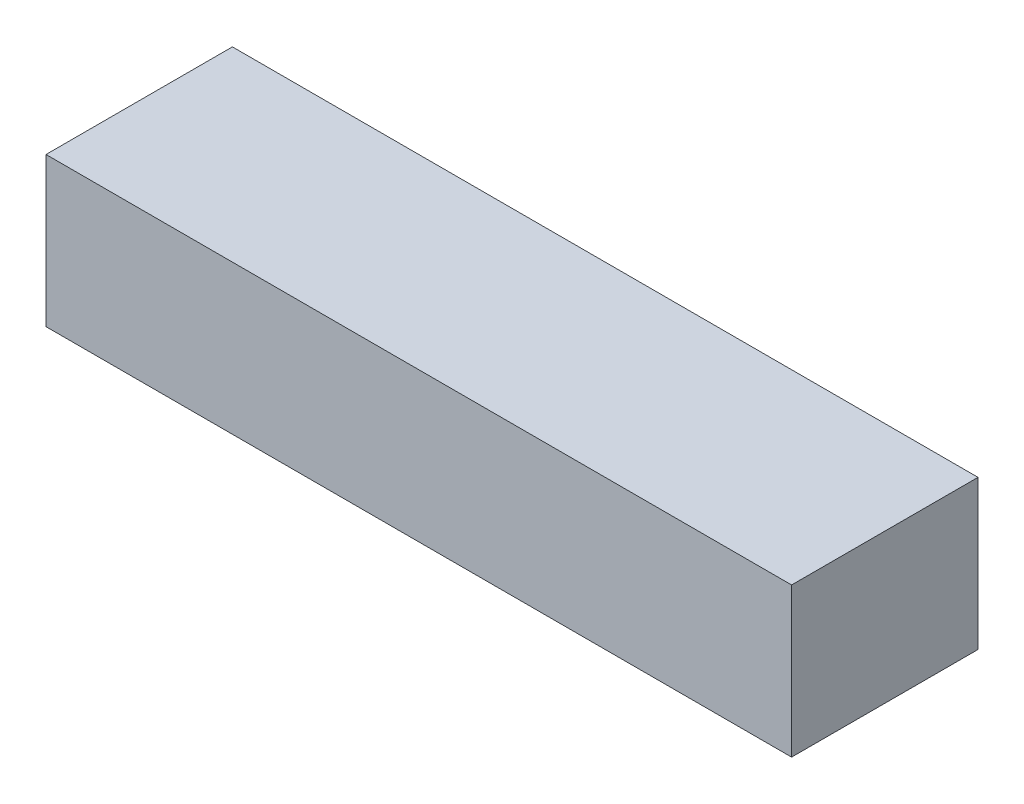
from build123d import *

# Parameters (mm, degrees)
SKETCH_2_W      = 20
SKETCH_2_H      = 5
EXTRUDE_1_DEPTH = 4


with BuildPart() as part:
    # Sketch 2 → Extrude 1 (new body)
    with BuildSketch(Plane(origin=(0, 0, 0), x_dir=(1, 0, 0), z_dir=(0, 1, 0))):
        with Locations((10, -2.5)):
            Rectangle(SKETCH_2_W, SKETCH_2_H)
    extrude(amount=EXTRUDE_1_DEPTH)


solid = part.part
